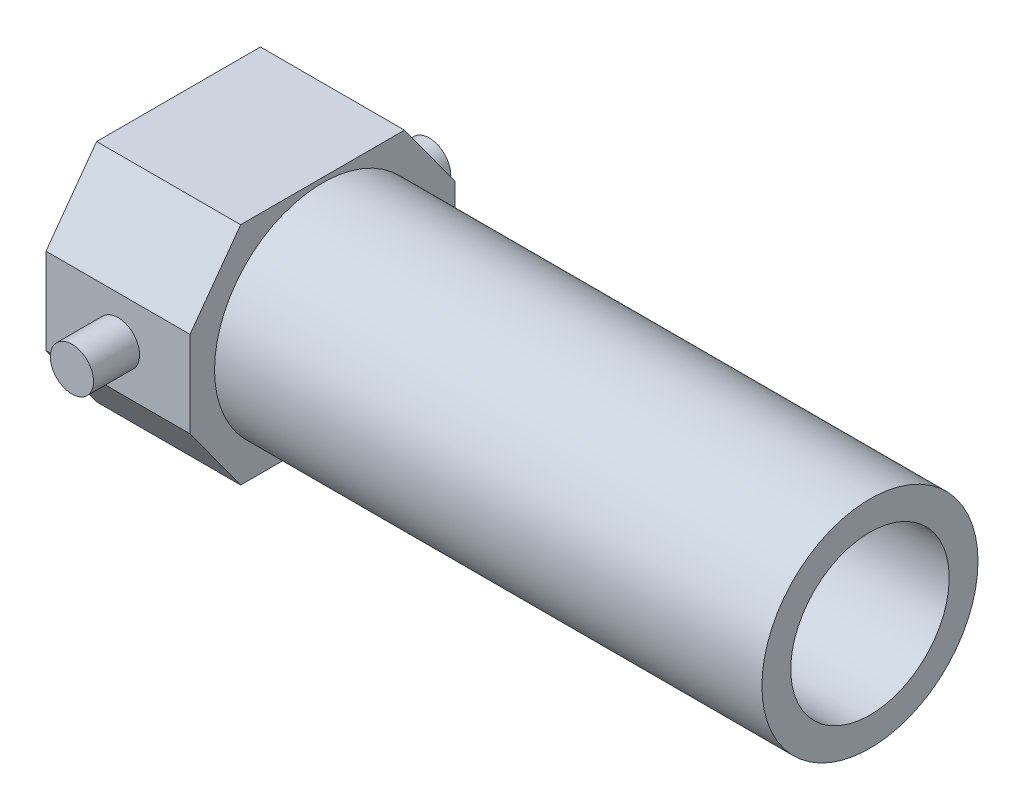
ISO-10303-21;
HEADER;
FILE_DESCRIPTION(('STEP AP214'),'2;1');
FILE_NAME('part.step','',(''),(''),'','','');
FILE_SCHEMA(('AUTOMOTIVE_DESIGN { 1 0 10303 214 1 1 1 1 }'));
ENDSEC;
DATA;
#1=APPLICATION_CONTEXT('core data for automotive mechanical design processes');
#2=APPLICATION_PROTOCOL_DEFINITION('international standard','automotive_design',2000,#1);
#3=PRODUCT_CONTEXT('',#1,'mechanical');
#4=PRODUCT('Part','Part','',(#3));
#5=PRODUCT_RELATED_PRODUCT_CATEGORY('part','',(#4));
#6=PRODUCT_DEFINITION_FORMATION('','',#4);
#7=PRODUCT_DEFINITION_CONTEXT('part definition',#1,'design');
#8=PRODUCT_DEFINITION('design','',#6,#7);
#9=PRODUCT_DEFINITION_SHAPE('','',#8);
#10=(LENGTH_UNIT() NAMED_UNIT(*) SI_UNIT(.MILLI.,.METRE.));
#11=(NAMED_UNIT(*) PLANE_ANGLE_UNIT() SI_UNIT($,.RADIAN.));
#12=(NAMED_UNIT(*) SI_UNIT($,.STERADIAN.) SOLID_ANGLE_UNIT());
#13=UNCERTAINTY_MEASURE_WITH_UNIT(LENGTH_MEASURE(1.E-05),#10,'distance_accuracy_value','');
#14=(GEOMETRIC_REPRESENTATION_CONTEXT(3) GLOBAL_UNCERTAINTY_ASSIGNED_CONTEXT((#13)) GLOBAL_UNIT_ASSIGNED_CONTEXT((#10,
#11,#12)) REPRESENTATION_CONTEXT('',''));
#15=CARTESIAN_POINT('',(0.,0.,0.));
#16=DIRECTION('',(0.,0.,1.));
#17=DIRECTION('',(1.,0.,0.));
#18=AXIS2_PLACEMENT_3D('',#15,#16,#17);
#19=CARTESIAN_POINT('',(-50.,29.8926120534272,92.));
#20=DIRECTION('',(0.,0.,1.));
#21=DIRECTION('',(0.,-1.,0.));
#22=AXIS2_PLACEMENT_3D('',#19,#20,#21);
#23=PLANE('',#22);
#24=DIRECTION('',(0.,-1.,0.));
#25=VECTOR('',#24,1.);
#26=CARTESIAN_POINT('',(49.9999999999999,29.892612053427,92.));
#27=LINE('',#26,#25);
#28=CARTESIAN_POINT('',(49.9999999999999,29.892612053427,92.));
#29=VERTEX_POINT('',#28);
#30=CARTESIAN_POINT('',(49.9999999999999,-29.8926120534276,92.));
#31=VERTEX_POINT('',#30);
#32=EDGE_CURVE('E139',#29,#31,#27,.T.);
#33=ORIENTED_EDGE('',*,*,#32,.F.);
#34=DIRECTION('',(1.,0.,0.));
#35=VECTOR('',#34,1.);
#36=CARTESIAN_POINT('',(-50.,29.8926120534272,92.));
#37=LINE('',#36,#35);
#38=CARTESIAN_POINT('',(-50.,29.8926120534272,92.));
#39=VERTEX_POINT('',#38);
#40=EDGE_CURVE('E94',#39,#29,#37,.T.);
#41=ORIENTED_EDGE('',*,*,#40,.F.);
#42=DIRECTION('',(0.,-1.,0.));
#43=VECTOR('',#42,1.);
#44=CARTESIAN_POINT('',(-50.,29.8926120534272,92.));
#45=LINE('',#44,#43);
#46=CARTESIAN_POINT('',(-50.,-29.8926120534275,92.0000000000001));
#47=VERTEX_POINT('',#46);
#48=EDGE_CURVE('E190',#39,#47,#45,.T.);
#49=ORIENTED_EDGE('',*,*,#48,.T.);
#50=DIRECTION('',(1.,0.,0.));
#51=VECTOR('',#50,1.);
#52=CARTESIAN_POINT('',(-50.,-29.8926120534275,92.0000000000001));
#53=LINE('',#52,#51);
#54=EDGE_CURVE('E165',#47,#31,#53,.T.);
#55=ORIENTED_EDGE('',*,*,#54,.T.);
#56=EDGE_LOOP('',(#33,#41,#49,#55));
#57=FACE_BOUND('',#56,.T.);
#58=CARTESIAN_POINT('',(0.,0.,92.));
#59=DIRECTION('',(0.,0.,1.));
#60=DIRECTION('',(1.,0.,0.));
#61=AXIS2_PLACEMENT_3D('',#58,#59,#60);
#62=CIRCLE('',#61,15.);
#63=CARTESIAN_POINT('',(15.,0.,92.));
#64=VERTEX_POINT('',#63);
#65=EDGE_CURVE('E178',#64,#64,#62,.T.);
#66=ORIENTED_EDGE('',*,*,#65,.F.);
#67=EDGE_LOOP('',(#66));
#68=FACE_BOUND('',#67,.T.);
#69=ADVANCED_FACE('F35',(#57,#68),#23,.T.);
#70=CARTESIAN_POINT('',(50.0000000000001,-6.66133814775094E-13,113.71825392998));
#71=DIRECTION('',(1.,0.,0.));
#72=DIRECTION('',(0.,0.,-1.));
#73=AXIS2_PLACEMENT_3D('',#70,#71,#72);
#74=PLANE('',#73);
#75=DIRECTION('',(0.,-0.809016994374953,0.587785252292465));
#76=VECTOR('',#75,1.);
#77=CARTESIAN_POINT('',(50.,78.2598743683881,56.8591269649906));
#78=LINE('',#77,#76);
#79=CARTESIAN_POINT('',(50.,78.2598743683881,56.8591269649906));
#80=VERTEX_POINT('',#79);
#81=EDGE_CURVE('E136',#80,#29,#78,.T.);
#82=ORIENTED_EDGE('',*,*,#81,.T.);
#83=ORIENTED_EDGE('',*,*,#32,.T.);
#84=DIRECTION('',(0.,-0.809016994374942,-0.587785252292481));
#85=VECTOR('',#84,1.);
#86=CARTESIAN_POINT('',(49.9999999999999,-29.8926120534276,92.));
#87=LINE('',#86,#85);
#88=CARTESIAN_POINT('',(50.,-78.2598743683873,56.8591269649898));
#89=VERTEX_POINT('',#88);
#90=EDGE_CURVE('E142',#31,#89,#87,.T.);
#91=ORIENTED_EDGE('',*,*,#90,.T.);
#92=DIRECTION('',(0.,0.,-1.));
#93=VECTOR('',#92,1.);
#94=CARTESIAN_POINT('',(50.,-78.2598743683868,-56.8591269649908));
#95=LINE('',#94,#93);
#96=CARTESIAN_POINT('',(50.,-78.2598743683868,-56.8591269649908));
#97=VERTEX_POINT('',#96);
#98=EDGE_CURVE('E145',#89,#97,#95,.T.);
#99=ORIENTED_EDGE('',*,*,#98,.T.);
#100=DIRECTION('',(0.,0.809016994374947,-0.587785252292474));
#101=VECTOR('',#100,1.);
#102=CARTESIAN_POINT('',(50.,-78.2598743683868,-56.8591269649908));
#103=LINE('',#102,#101);
#104=CARTESIAN_POINT('',(50.,-29.8926120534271,-92.));
#105=VERTEX_POINT('',#104);
#106=EDGE_CURVE('E148',#97,#105,#103,.T.);
#107=ORIENTED_EDGE('',*,*,#106,.T.);
#108=DIRECTION('',(0.,1.,0.));
#109=VECTOR('',#108,1.);
#110=CARTESIAN_POINT('',(50.,-29.8926120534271,-92.));
#111=LINE('',#110,#109);
#112=CARTESIAN_POINT('',(50.,29.8926120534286,-92.));
#113=VERTEX_POINT('',#112);
#114=EDGE_CURVE('E151',#105,#113,#111,.T.);
#115=ORIENTED_EDGE('',*,*,#114,.T.);
#116=DIRECTION('',(0.,0.809016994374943,0.587785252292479));
#117=VECTOR('',#116,1.);
#118=CARTESIAN_POINT('',(50.,29.8926120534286,-92.));
#119=LINE('',#118,#117);
#120=CARTESIAN_POINT('',(50.0000000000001,78.2598743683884,-56.8591269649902));
#121=VERTEX_POINT('',#120);
#122=EDGE_CURVE('E113',#113,#121,#119,.T.);
#123=ORIENTED_EDGE('',*,*,#122,.T.);
#124=DIRECTION('',(0.,0.,1.));
#125=VECTOR('',#124,1.);
#126=CARTESIAN_POINT('',(50.0000000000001,78.2598743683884,-56.8591269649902));
#127=LINE('',#126,#125);
#128=EDGE_CURVE('E154',#121,#80,#127,.T.);
#129=ORIENTED_EDGE('',*,*,#128,.T.);
#130=EDGE_LOOP('',(#82,#83,#91,#99,#107,#115,#123,#129));
#131=FACE_BOUND('',#130,.T.);
#132=CARTESIAN_POINT('',(50.0000000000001,0.,0.));
#133=DIRECTION('',(1.,0.,0.));
#134=DIRECTION('',(0.,0.,-1.));
#135=AXIS2_PLACEMENT_3D('',#132,#133,#134);
#136=CIRCLE('',#135,75.);
#137=CARTESIAN_POINT('',(50.0000000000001,0.,-75.));
#138=VERTEX_POINT('',#137);
#139=EDGE_CURVE('E184',#138,#138,#136,.T.);
#140=ORIENTED_EDGE('',*,*,#139,.F.);
#141=EDGE_LOOP('',(#140));
#142=FACE_BOUND('',#141,.T.);
#143=ADVANCED_FACE('F207',(#131,#142),#74,.T.);
#144=CARTESIAN_POINT('',(-50.,78.2598743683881,56.8591269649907));
#145=DIRECTION('',(0.,0.587785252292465,0.809016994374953));
#146=DIRECTION('',(0.,-0.809016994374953,0.587785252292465));
#147=AXIS2_PLACEMENT_3D('',#144,#145,#146);
#148=PLANE('',#147);
#149=ORIENTED_EDGE('',*,*,#81,.F.);
#150=DIRECTION('',(1.,0.,0.));
#151=VECTOR('',#150,1.);
#152=CARTESIAN_POINT('',(-50.,78.2598743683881,56.8591269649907));
#153=LINE('',#152,#151);
#154=CARTESIAN_POINT('',(-50.,78.2598743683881,56.8591269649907));
#155=VERTEX_POINT('',#154);
#156=EDGE_CURVE('E45',#155,#80,#153,.T.);
#157=ORIENTED_EDGE('',*,*,#156,.F.);
#158=DIRECTION('',(0.,-0.809016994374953,0.587785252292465));
#159=VECTOR('',#158,1.);
#160=CARTESIAN_POINT('',(-50.,78.2598743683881,56.8591269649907));
#161=LINE('',#160,#159);
#162=EDGE_CURVE('E157',#155,#39,#161,.T.);
#163=ORIENTED_EDGE('',*,*,#162,.T.);
#164=ORIENTED_EDGE('',*,*,#40,.T.);
#165=EDGE_LOOP('',(#149,#157,#163,#164));
#166=FACE_BOUND('',#165,.T.);
#167=ADVANCED_FACE('F205',(#166),#148,.T.);
#168=CARTESIAN_POINT('',(-50.,78.2598743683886,-56.8591269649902));
#169=DIRECTION('',(0.,1.,0.));
#170=DIRECTION('',(0.,0.,1.));
#171=AXIS2_PLACEMENT_3D('',#168,#169,#170);
#172=PLANE('',#171);
#173=ORIENTED_EDGE('',*,*,#128,.F.);
#174=DIRECTION('',(1.,0.,0.));
#175=VECTOR('',#174,1.);
#176=CARTESIAN_POINT('',(-50.,78.2598743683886,-56.8591269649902));
#177=LINE('',#176,#175);
#178=CARTESIAN_POINT('',(-50.,78.2598743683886,-56.8591269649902));
#179=VERTEX_POINT('',#178);
#180=EDGE_CURVE('E82',#179,#121,#177,.T.);
#181=ORIENTED_EDGE('',*,*,#180,.F.);
#182=DIRECTION('',(0.,0.,1.));
#183=VECTOR('',#182,1.);
#184=CARTESIAN_POINT('',(-50.,78.2598743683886,-56.8591269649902));
#185=LINE('',#184,#183);
#186=EDGE_CURVE('E126',#179,#155,#185,.T.);
#187=ORIENTED_EDGE('',*,*,#186,.T.);
#188=ORIENTED_EDGE('',*,*,#156,.T.);
#189=EDGE_LOOP('',(#173,#181,#187,#188));
#190=FACE_BOUND('',#189,.T.);
#191=ADVANCED_FACE('F209',(#190),#172,.T.);
#192=CARTESIAN_POINT('',(-50.,29.8926120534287,-92.));
#193=DIRECTION('',(0.,0.587785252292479,-0.809016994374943));
#194=DIRECTION('',(0.,0.809016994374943,0.587785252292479));
#195=AXIS2_PLACEMENT_3D('',#192,#193,#194);
#196=PLANE('',#195);
#197=ORIENTED_EDGE('',*,*,#122,.F.);
#198=DIRECTION('',(1.,0.,0.));
#199=VECTOR('',#198,1.);
#200=CARTESIAN_POINT('',(-50.,29.8926120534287,-92.));
#201=LINE('',#200,#199);
#202=CARTESIAN_POINT('',(-50.,29.8926120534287,-92.));
#203=VERTEX_POINT('',#202);
#204=EDGE_CURVE('E108',#203,#113,#201,.T.);
#205=ORIENTED_EDGE('',*,*,#204,.F.);
#206=DIRECTION('',(0.,0.809016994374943,0.587785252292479));
#207=VECTOR('',#206,1.);
#208=CARTESIAN_POINT('',(-50.,29.8926120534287,-92.));
#209=LINE('',#208,#207);
#210=EDGE_CURVE('E111',#203,#179,#209,.T.);
#211=ORIENTED_EDGE('',*,*,#210,.T.);
#212=ORIENTED_EDGE('',*,*,#180,.T.);
#213=EDGE_LOOP('',(#197,#205,#211,#212));
#214=FACE_BOUND('',#213,.T.);
#215=ADVANCED_FACE('F110',(#214),#196,.T.);
#216=CARTESIAN_POINT('',(-50.,-29.892612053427,-92.));
#217=DIRECTION('',(0.,0.,-1.));
#218=DIRECTION('',(0.,1.,0.));
#219=AXIS2_PLACEMENT_3D('',#216,#217,#218);
#220=PLANE('',#219);
#221=CARTESIAN_POINT('',(0.,0.,-92.));
#222=DIRECTION('',(0.,0.,-1.));
#223=DIRECTION('',(0.,1.,0.));
#224=AXIS2_PLACEMENT_3D('',#221,#222,#223);
#225=CIRCLE('',#224,15.);
#226=CARTESIAN_POINT('',(0.,15.,-92.));
#227=VERTEX_POINT('',#226);
#228=EDGE_CURVE('E12',#227,#227,#225,.T.);
#229=ORIENTED_EDGE('',*,*,#228,.F.);
#230=EDGE_LOOP('',(#229));
#231=FACE_BOUND('',#230,.T.);
#232=ORIENTED_EDGE('',*,*,#114,.F.);
#233=DIRECTION('',(1.,0.,0.));
#234=VECTOR('',#233,1.);
#235=CARTESIAN_POINT('',(-50.,-29.892612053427,-92.));
#236=LINE('',#235,#234);
#237=CARTESIAN_POINT('',(-50.,-29.892612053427,-92.));
#238=VERTEX_POINT('',#237);
#239=EDGE_CURVE('E118',#238,#105,#236,.T.);
#240=ORIENTED_EDGE('',*,*,#239,.F.);
#241=DIRECTION('',(0.,1.,0.));
#242=VECTOR('',#241,1.);
#243=CARTESIAN_POINT('',(-50.,-29.892612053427,-92.));
#244=LINE('',#243,#242);
#245=EDGE_CURVE('E124',#238,#203,#244,.T.);
#246=ORIENTED_EDGE('',*,*,#245,.T.);
#247=ORIENTED_EDGE('',*,*,#204,.T.);
#248=EDGE_LOOP('',(#232,#240,#246,#247));
#249=FACE_BOUND('',#248,.T.);
#250=ADVANCED_FACE('F128',(#231,#249),#220,.T.);
#251=CARTESIAN_POINT('',(-49.9999999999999,-78.2598743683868,-56.8591269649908));
#252=DIRECTION('',(0.,-0.587785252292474,-0.809016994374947));
#253=DIRECTION('',(0.,0.809016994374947,-0.587785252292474));
#254=AXIS2_PLACEMENT_3D('',#251,#252,#253);
#255=PLANE('',#254);
#256=ORIENTED_EDGE('',*,*,#106,.F.);
#257=DIRECTION('',(1.,0.,0.));
#258=VECTOR('',#257,1.);
#259=CARTESIAN_POINT('',(-49.9999999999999,-78.2598743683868,-56.8591269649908));
#260=LINE('',#259,#258);
#261=CARTESIAN_POINT('',(-49.9999999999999,-78.2598743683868,-56.8591269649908));
#262=VERTEX_POINT('',#261);
#263=EDGE_CURVE('E161',#262,#97,#260,.T.);
#264=ORIENTED_EDGE('',*,*,#263,.F.);
#265=DIRECTION('',(0.,0.809016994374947,-0.587785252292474));
#266=VECTOR('',#265,1.);
#267=CARTESIAN_POINT('',(-49.9999999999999,-78.2598743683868,-56.8591269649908));
#268=LINE('',#267,#266);
#269=EDGE_CURVE('E129',#262,#238,#268,.T.);
#270=ORIENTED_EDGE('',*,*,#269,.T.);
#271=ORIENTED_EDGE('',*,*,#239,.T.);
#272=EDGE_LOOP('',(#256,#264,#270,#271));
#273=FACE_BOUND('',#272,.T.);
#274=ADVANCED_FACE('F228',(#273),#255,.T.);
#275=CARTESIAN_POINT('',(-49.9999999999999,-78.2598743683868,-56.8591269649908));
#276=DIRECTION('',(0.,-1.,0.));
#277=DIRECTION('',(0.,0.,-1.));
#278=AXIS2_PLACEMENT_3D('',#275,#276,#277);
#279=PLANE('',#278);
#280=ORIENTED_EDGE('',*,*,#98,.F.);
#281=DIRECTION('',(1.,0.,0.));
#282=VECTOR('',#281,1.);
#283=CARTESIAN_POINT('',(-49.9999999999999,-78.2598743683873,56.8591269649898));
#284=LINE('',#283,#282);
#285=CARTESIAN_POINT('',(-49.9999999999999,-78.2598743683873,56.8591269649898));
#286=VERTEX_POINT('',#285);
#287=EDGE_CURVE('E163',#286,#89,#284,.T.);
#288=ORIENTED_EDGE('',*,*,#287,.F.);
#289=DIRECTION('',(0.,0.,-1.));
#290=VECTOR('',#289,1.);
#291=CARTESIAN_POINT('',(-49.9999999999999,-78.2598743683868,-56.8591269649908));
#292=LINE('',#291,#290);
#293=EDGE_CURVE('E131',#286,#262,#292,.T.);
#294=ORIENTED_EDGE('',*,*,#293,.T.);
#295=ORIENTED_EDGE('',*,*,#263,.T.);
#296=EDGE_LOOP('',(#280,#288,#294,#295));
#297=FACE_BOUND('',#296,.T.);
#298=ADVANCED_FACE('F198',(#297),#279,.T.);
#299=CARTESIAN_POINT('',(-50.,-29.8926120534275,92.0000000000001));
#300=DIRECTION('',(0.,-0.587785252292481,0.809016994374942));
#301=DIRECTION('',(0.,-0.809016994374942,-0.587785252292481));
#302=AXIS2_PLACEMENT_3D('',#299,#300,#301);
#303=PLANE('',#302);
#304=ORIENTED_EDGE('',*,*,#90,.F.);
#305=ORIENTED_EDGE('',*,*,#54,.F.);
#306=DIRECTION('',(0.,-0.809016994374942,-0.587785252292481));
#307=VECTOR('',#306,1.);
#308=CARTESIAN_POINT('',(-50.,-29.8926120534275,92.0000000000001));
#309=LINE('',#308,#307);
#310=EDGE_CURVE('E192',#47,#286,#309,.T.);
#311=ORIENTED_EDGE('',*,*,#310,.T.);
#312=ORIENTED_EDGE('',*,*,#287,.T.);
#313=EDGE_LOOP('',(#304,#305,#311,#312));
#314=FACE_BOUND('',#313,.T.);
#315=ADVANCED_FACE('F203',(#314),#303,.T.);
#316=CARTESIAN_POINT('',(-50.,-6.66133814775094E-13,113.71825392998));
#317=DIRECTION('',(1.,0.,0.));
#318=DIRECTION('',(0.,0.,-1.));
#319=AXIS2_PLACEMENT_3D('',#316,#317,#318);
#320=PLANE('',#319);
#321=ORIENTED_EDGE('',*,*,#162,.F.);
#322=ORIENTED_EDGE('',*,*,#186,.F.);
#323=ORIENTED_EDGE('',*,*,#210,.F.);
#324=ORIENTED_EDGE('',*,*,#245,.F.);
#325=ORIENTED_EDGE('',*,*,#269,.F.);
#326=ORIENTED_EDGE('',*,*,#293,.F.);
#327=ORIENTED_EDGE('',*,*,#310,.F.);
#328=ORIENTED_EDGE('',*,*,#48,.F.);
#329=EDGE_LOOP('',(#321,#322,#323,#324,#325,#326,#327,#328));
#330=FACE_BOUND('',#329,.T.);
#331=ADVANCED_FACE('F122',(#330),#320,.F.);
#332=CARTESIAN_POINT('',(470.,0.,0.));
#333=DIRECTION('',(-1.,0.,0.));
#334=DIRECTION('',(0.,0.,1.));
#335=AXIS2_PLACEMENT_3D('',#332,#333,#334);
#336=CYLINDRICAL_SURFACE('',#335,75.);
#337=CARTESIAN_POINT('',(430.,0.,0.));
#338=DIRECTION('',(1.,0.,0.));
#339=DIRECTION('',(0.,0.,-1.));
#340=AXIS2_PLACEMENT_3D('',#337,#338,#339);
#341=CIRCLE('',#340,75.);
#342=CARTESIAN_POINT('',(430.,0.,-75.0000000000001));
#343=VERTEX_POINT('',#342);
#344=EDGE_CURVE('E39',#343,#343,#341,.T.);
#345=ORIENTED_EDGE('',*,*,#344,.F.);
#346=EDGE_LOOP('',(#345));
#347=FACE_BOUND('',#346,.T.);
#348=ORIENTED_EDGE('',*,*,#139,.T.);
#349=EDGE_LOOP('',(#348));
#350=FACE_BOUND('',#349,.T.);
#351=ADVANCED_FACE('F259',(#347,#350),#336,.T.);
#352=CARTESIAN_POINT('',(430.,0.,0.));
#353=DIRECTION('',(1.,0.,0.));
#354=DIRECTION('',(0.,0.,-1.));
#355=AXIS2_PLACEMENT_3D('',#352,#353,#354);
#356=PLANE('',#355);
#357=CARTESIAN_POINT('',(430.,0.,0.));
#358=DIRECTION('',(1.,0.,0.));
#359=DIRECTION('',(0.,0.,-1.));
#360=AXIS2_PLACEMENT_3D('',#357,#358,#359);
#361=CIRCLE('',#360,55.);
#362=CARTESIAN_POINT('',(430.,0.,-55.0000000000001));
#363=VERTEX_POINT('',#362);
#364=EDGE_CURVE('E167',#363,#363,#361,.T.);
#365=ORIENTED_EDGE('',*,*,#364,.F.);
#366=EDGE_LOOP('',(#365));
#367=FACE_BOUND('',#366,.T.);
#368=ORIENTED_EDGE('',*,*,#344,.T.);
#369=EDGE_LOOP('',(#368));
#370=FACE_BOUND('',#369,.T.);
#371=ADVANCED_FACE('F37',(#367,#370),#356,.T.);
#372=CARTESIAN_POINT('',(0.,0.,124.));
#373=DIRECTION('',(0.,0.,-1.));
#374=DIRECTION('',(-1.,0.,0.));
#375=AXIS2_PLACEMENT_3D('',#372,#373,#374);
#376=CYLINDRICAL_SURFACE('',#375,15.);
#377=CARTESIAN_POINT('',(0.,0.,124.));
#378=DIRECTION('',(0.,0.,1.));
#379=DIRECTION('',(1.,0.,0.));
#380=AXIS2_PLACEMENT_3D('',#377,#378,#379);
#381=CIRCLE('',#380,15.);
#382=CARTESIAN_POINT('',(15.,0.,124.));
#383=VERTEX_POINT('',#382);
#384=EDGE_CURVE('E181',#383,#383,#381,.T.);
#385=ORIENTED_EDGE('',*,*,#384,.F.);
#386=EDGE_LOOP('',(#385));
#387=FACE_BOUND('',#386,.T.);
#388=ORIENTED_EDGE('',*,*,#65,.T.);
#389=EDGE_LOOP('',(#388));
#390=FACE_BOUND('',#389,.T.);
#391=ADVANCED_FACE('F251',(#387,#390),#376,.T.);
#392=CARTESIAN_POINT('',(0.,0.,124.));
#393=DIRECTION('',(0.,0.,1.));
#394=DIRECTION('',(1.,0.,0.));
#395=AXIS2_PLACEMENT_3D('',#392,#393,#394);
#396=PLANE('',#395);
#397=ORIENTED_EDGE('',*,*,#384,.T.);
#398=EDGE_LOOP('',(#397));
#399=FACE_BOUND('',#398,.T.);
#400=ADVANCED_FACE('F241',(#399),#396,.T.);
#401=CARTESIAN_POINT('',(0.,0.,-124.));
#402=DIRECTION('',(0.,0.,1.));
#403=DIRECTION('',(1.,0.,0.));
#404=AXIS2_PLACEMENT_3D('',#401,#402,#403);
#405=CYLINDRICAL_SURFACE('',#404,15.);
#406=CARTESIAN_POINT('',(0.,0.,-124.));
#407=DIRECTION('',(0.,0.,1.));
#408=DIRECTION('',(1.,0.,0.));
#409=AXIS2_PLACEMENT_3D('',#406,#407,#408);
#410=CIRCLE('',#409,15.);
#411=CARTESIAN_POINT('',(15.0000000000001,0.,-124.));
#412=VERTEX_POINT('',#411);
#413=EDGE_CURVE('E173',#412,#412,#410,.T.);
#414=ORIENTED_EDGE('',*,*,#413,.T.);
#415=EDGE_LOOP('',(#414));
#416=FACE_BOUND('',#415,.T.);
#417=ORIENTED_EDGE('',*,*,#228,.T.);
#418=EDGE_LOOP('',(#417));
#419=FACE_BOUND('',#418,.T.);
#420=ADVANCED_FACE('F238',(#416,#419),#405,.T.);
#421=CARTESIAN_POINT('',(0.,0.,-124.));
#422=DIRECTION('',(0.,0.,-1.));
#423=DIRECTION('',(1.,0.,0.));
#424=AXIS2_PLACEMENT_3D('',#421,#422,#423);
#425=PLANE('',#424);
#426=ORIENTED_EDGE('',*,*,#413,.F.);
#427=EDGE_LOOP('',(#426));
#428=FACE_BOUND('',#427,.T.);
#429=ADVANCED_FACE('F240',(#428),#425,.T.);
#430=CARTESIAN_POINT('',(70.0000000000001,1.11022302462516E-13,0.));
#431=DIRECTION('',(1.,0.,0.));
#432=DIRECTION('',(0.,0.,-1.));
#433=AXIS2_PLACEMENT_3D('',#430,#431,#432);
#434=CYLINDRICAL_SURFACE('',#433,55.);
#435=CARTESIAN_POINT('',(70.0000000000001,1.11022302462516E-13,0.));
#436=DIRECTION('',(1.,0.,0.));
#437=DIRECTION('',(0.,0.,-1.));
#438=AXIS2_PLACEMENT_3D('',#435,#436,#437);
#439=CIRCLE('',#438,55.);
#440=CARTESIAN_POINT('',(70.0000000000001,1.09397106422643E-13,-55.));
#441=VERTEX_POINT('',#440);
#442=EDGE_CURVE('E169',#441,#441,#439,.T.);
#443=ORIENTED_EDGE('',*,*,#442,.F.);
#444=EDGE_LOOP('',(#443));
#445=FACE_BOUND('',#444,.T.);
#446=ORIENTED_EDGE('',*,*,#364,.T.);
#447=EDGE_LOOP('',(#446));
#448=FACE_BOUND('',#447,.T.);
#449=ADVANCED_FACE('F248',(#445,#448),#434,.F.);
#450=CARTESIAN_POINT('',(70.0000000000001,1.11022302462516E-13,0.));
#451=DIRECTION('',(1.,0.,0.));
#452=DIRECTION('',(0.,0.,-1.));
#453=AXIS2_PLACEMENT_3D('',#450,#451,#452);
#454=PLANE('',#453);
#455=ORIENTED_EDGE('',*,*,#442,.T.);
#456=EDGE_LOOP('',(#455));
#457=FACE_BOUND('',#456,.T.);
#458=ADVANCED_FACE('F354',(#457),#454,.T.);
#459=CLOSED_SHELL('',(#69,#143,#167,#191,#215,#250,#274,#298,#315,#331,#351,#371,#391,#400,#420,
#429,#449,#458));
#460=MANIFOLD_SOLID_BREP('B2',#459);
#461=ADVANCED_BREP_SHAPE_REPRESENTATION('',(#18,#460),#14);
#462=SHAPE_DEFINITION_REPRESENTATION(#9,#461);
ENDSEC;
END-ISO-10303-21;
